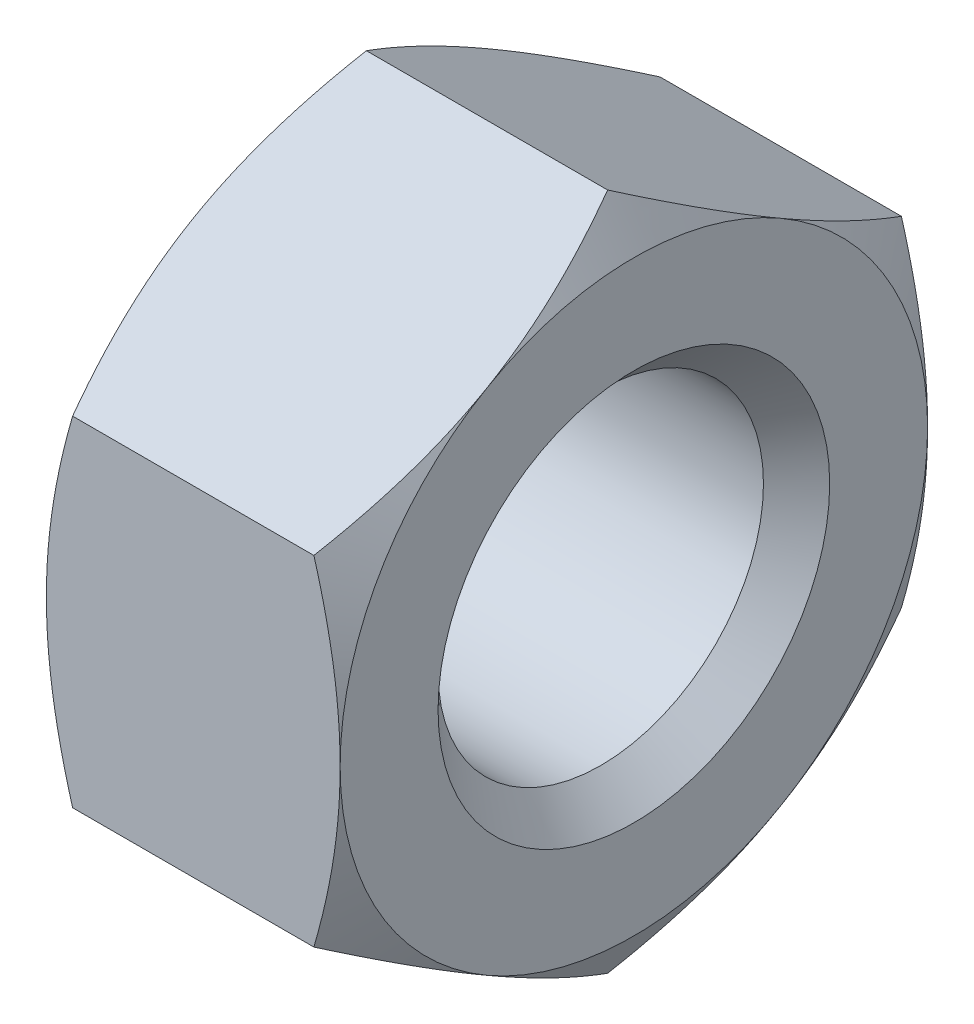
ISO-10303-21;
HEADER;
FILE_DESCRIPTION(('STEP AP214'),'2;1');
FILE_NAME('part.step','',(''),(''),'','','');
FILE_SCHEMA(('AUTOMOTIVE_DESIGN { 1 0 10303 214 1 1 1 1 }'));
ENDSEC;
DATA;
#1=APPLICATION_CONTEXT('core data for automotive mechanical design processes');
#2=APPLICATION_PROTOCOL_DEFINITION('international standard','automotive_design',2000,#1);
#3=PRODUCT_CONTEXT('',#1,'mechanical');
#4=PRODUCT('Part','Part','',(#3));
#5=PRODUCT_RELATED_PRODUCT_CATEGORY('part','',(#4));
#6=PRODUCT_DEFINITION_FORMATION('','',#4);
#7=PRODUCT_DEFINITION_CONTEXT('part definition',#1,'design');
#8=PRODUCT_DEFINITION('design','',#6,#7);
#9=PRODUCT_DEFINITION_SHAPE('','',#8);
#10=(LENGTH_UNIT() NAMED_UNIT(*) SI_UNIT(.MILLI.,.METRE.));
#11=(NAMED_UNIT(*) PLANE_ANGLE_UNIT() SI_UNIT($,.RADIAN.));
#12=(NAMED_UNIT(*) SI_UNIT($,.STERADIAN.) SOLID_ANGLE_UNIT());
#13=UNCERTAINTY_MEASURE_WITH_UNIT(LENGTH_MEASURE(1.E-05),#10,'distance_accuracy_value','');
#14=(GEOMETRIC_REPRESENTATION_CONTEXT(3) GLOBAL_UNCERTAINTY_ASSIGNED_CONTEXT((#13)) GLOBAL_UNIT_ASSIGNED_CONTEXT((#10,
#11,#12)) REPRESENTATION_CONTEXT('',''));
#15=CARTESIAN_POINT('',(0.,0.,0.));
#16=DIRECTION('',(0.,0.,1.));
#17=DIRECTION('',(1.,0.,0.));
#18=AXIS2_PLACEMENT_3D('',#15,#16,#17);
#19=CARTESIAN_POINT('',(-2.30717967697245,0.,0.));
#20=DIRECTION('',(1.,0.,0.));
#21=DIRECTION('',(0.,0.,-1.));
#22=AXIS2_PLACEMENT_3D('',#19,#20,#21);
#23=CONICAL_SURFACE('',#22,7.2,1.0471975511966);
#24=CARTESIAN_POINT('',(-0.118306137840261,-9.20909119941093,-6.));
#25=CARTESIAN_POINT('',(-0.244656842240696,-8.94782108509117,-6.));
#26=CARTESIAN_POINT('',(-0.369767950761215,-8.68594078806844,-6.));
#27=CARTESIAN_POINT('',(-0.616811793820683,-8.16063496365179,-6.));
#28=CARTESIAN_POINT('',(-0.73874400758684,-7.89720919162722,-6.));
#29=CARTESIAN_POINT('',(-0.9793650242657,-7.36708364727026,-6.));
#30=CARTESIAN_POINT('',(-1.09803169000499,-7.10037379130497,-6.));
#31=CARTESIAN_POINT('',(-1.33037878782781,-6.56479885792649,-6.));
#32=CARTESIAN_POINT('',(-1.44405946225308,-6.29593388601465,-6.));
#33=CARTESIAN_POINT('',(-1.66851104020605,-5.74732037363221,-6.));
#34=CARTESIAN_POINT('',(-1.77908558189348,-5.46749104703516,-6.));
#35=CARTESIAN_POINT('',(-1.99163115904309,-4.90452304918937,-6.));
#36=CARTESIAN_POINT('',(-2.09360121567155,-4.62138400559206,-6.));
#37=CARTESIAN_POINT('',(-2.28619063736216,-4.05190899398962,-6.));
#38=CARTESIAN_POINT('',(-2.37683383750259,-3.7655811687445,-6.));
#39=CARTESIAN_POINT('',(-2.54379680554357,-3.18881717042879,-6.));
#40=CARTESIAN_POINT('',(-2.6201211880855,-2.89838235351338,-6.));
#41=CARTESIAN_POINT('',(-2.75432444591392,-2.31484737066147,-6.));
#42=CARTESIAN_POINT('',(-2.81229968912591,-2.0217697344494,-6.));
#43=CARTESIAN_POINT('',(-2.90644807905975,-1.43203168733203,-6.));
#44=CARTESIAN_POINT('',(-2.94262309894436,-1.13537158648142,-6.));
#45=CARTESIAN_POINT('',(-2.97813125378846,-0.690839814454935,-6.));
#46=CARTESIAN_POINT('',(-2.98684433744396,-0.543679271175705,-6.));
#47=CARTESIAN_POINT('',(-2.9980522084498,-0.249115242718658,-6.));
#48=CARTESIAN_POINT('',(-3.00054709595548,-0.101711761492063,-6.));
#49=CARTESIAN_POINT('',(-2.99925213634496,0.19306753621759,-6.));
#50=CARTESIAN_POINT('',(-2.995462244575,0.340443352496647,-6.));
#51=CARTESIAN_POINT('',(-2.98169046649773,0.634907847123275,-6.));
#52=CARTESIAN_POINT('',(-2.9717082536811,0.781996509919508,-6.));
#53=CARTESIAN_POINT('',(-2.94022031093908,1.13846097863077,-6.));
#54=CARTESIAN_POINT('',(-2.91561188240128,1.34756813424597,-6.));
#55=CARTESIAN_POINT('',(-2.85524472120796,1.76415682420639,-6.));
#56=CARTESIAN_POINT('',(-2.81948438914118,1.97163812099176,-6.));
#57=CARTESIAN_POINT('',(-2.69737811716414,2.59144783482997,-6.));
#58=CARTESIAN_POINT('',(-2.59623155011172,3.00089489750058,-6.));
#59=CARTESIAN_POINT('',(-2.4217707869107,3.61299325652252,-6.));
#60=CARTESIAN_POINT('',(-2.3590393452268,3.8188425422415,-6.));
#61=CARTESIAN_POINT('',(-2.22729411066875,4.22854051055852,-6.));
#62=CARTESIAN_POINT('',(-2.15828027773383,4.4323891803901,-6.));
#63=CARTESIAN_POINT('',(-2.01505801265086,4.83815451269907,-6.));
#64=CARTESIAN_POINT('',(-1.94085144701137,5.0400718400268,-6.));
#65=CARTESIAN_POINT('',(-1.78809344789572,5.4422495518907,-6.));
#66=CARTESIAN_POINT('',(-1.70954205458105,5.64250995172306,-6.));
#67=CARTESIAN_POINT('',(-1.52643465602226,6.09713936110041,-6.));
#68=CARTESIAN_POINT('',(-1.42072916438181,6.35104440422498,-6.));
#69=CARTESIAN_POINT('',(-1.20459094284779,6.85683967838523,-6.));
#70=CARTESIAN_POINT('',(-1.09415798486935,7.10872981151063,-6.));
#71=CARTESIAN_POINT('',(-0.86946780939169,7.61084474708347,-6.));
#72=CARTESIAN_POINT('',(-0.755209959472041,7.86106926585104,-6.));
#73=CARTESIAN_POINT('',(-0.52359145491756,8.3600801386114,-6.));
#74=CARTESIAN_POINT('',(-0.406230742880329,8.60886646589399,-6.));
#75=CARTESIAN_POINT('',(-0.0501523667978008,9.35383732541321,-6.));
#76=CARTESIAN_POINT('',(0.192366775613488,9.84820396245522,-6.));
#77=CARTESIAN_POINT('',(0.684389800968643,10.833448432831,-6.));
#78=CARTESIAN_POINT('',(0.933893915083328,11.3243261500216,-6.));
#79=CARTESIAN_POINT('',(1.30210957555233,12.0396203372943,-6.));
#80=CARTESIAN_POINT('',(1.41883814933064,12.2650605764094,-6.));
#81=CARTESIAN_POINT('',(1.6532287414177,12.7154504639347,-6.));
#82=CARTESIAN_POINT('',(1.77089074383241,12.9404001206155,-6.));
#83=CARTESIAN_POINT('',(2.12510158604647,13.6146260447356,-6.));
#84=CARTESIAN_POINT('',(2.3628669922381,14.0632632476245,-6.));
#85=CARTESIAN_POINT('',(2.84036252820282,14.9582212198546,-6.));
#86=CARTESIAN_POINT('',(3.08008718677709,15.4045449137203,-6.));
#87=CARTESIAN_POINT('',(3.56150708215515,16.2961005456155,-6.));
#88=CARTESIAN_POINT('',(3.80320222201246,16.7413325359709,-6.));
#89=CARTESIAN_POINT('',(4.04563992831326,17.1861572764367,-6.));
#90=B_SPLINE_CURVE_WITH_KNOTS('',3,(#24,#25,#26,#27,#28,#29,#30,#31,#32,#33,#34,#35,#36,#37,#38,
#39,#40,#41,#42,#43,#44,#45,#46,#47,#48,#49,#50,#51,#52,#53,#54,#55,#56,#57,#58,#59,#60,#61,#62,
#63,#64,#65,#66,#67,#68,#69,#70,#71,#72,#73,#74,#75,#76,#77,#78,#79,#80,#81,#82,#83,#84,#85,#86,
#87,#88,#89),.UNSPECIFIED.,.F.,.F.,(4,2,2,2,2,2,2,2,2,2,2,2,2,2,2,2,2,2,2,2,2,2,2,2,2,2,2,2,2,2,
2,2,4),(0.,0.870665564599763,1.74147287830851,2.61718508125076,3.49285467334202,
4.39539749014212,5.29804284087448,6.19875557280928,7.09917752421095,7.99478890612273,
8.89032332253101,9.33246667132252,9.77460289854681,10.2167422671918,10.658904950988,
11.290196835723,11.9215793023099,13.1850861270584,13.830622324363,14.4761626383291,
15.1214720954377,15.7667755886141,16.5918024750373,17.4168692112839,18.2420730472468,
19.0672921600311,20.7191456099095,22.3710537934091,23.1326554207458,23.894244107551,
25.4174755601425,26.9373569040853,28.457163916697),.UNSPECIFIED.);
#91=CARTESIAN_POINT('',(-2.46410161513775,-3.46410161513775,-6.));
#92=VERTEX_POINT('',#91);
#93=CARTESIAN_POINT('',(-3.,0.,-6.));
#94=VERTEX_POINT('',#93);
#95=EDGE_CURVE('E333',#92,#94,#90,.T.);
#96=ORIENTED_EDGE('',*,*,#95,.F.);
#97=CARTESIAN_POINT('',(-2.46403494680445,-6.92831870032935,0.000200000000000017));
#98=CARTESIAN_POINT('',(-2.50799100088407,-6.85217369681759,-0.131687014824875));
#99=CARTESIAN_POINT('',(-2.5499521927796,-6.7757447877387,-0.264065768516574));
#100=CARTESIAN_POINT('',(-2.62933542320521,-6.62226628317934,-0.52989833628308));
#101=CARTESIAN_POINT('',(-2.66675550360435,-6.54521643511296,-0.663352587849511));
#102=CARTESIAN_POINT('',(-2.77146958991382,-6.31283321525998,-1.06585213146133));
#103=CARTESIAN_POINT('',(-2.83102994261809,-6.15658254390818,-1.33648623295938));
#104=CARTESIAN_POINT('',(-2.90087178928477,-5.92275625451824,-1.74148524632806));
#105=CARTESIAN_POINT('',(-2.92076777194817,-5.84587929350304,-1.87464004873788));
#106=CARTESIAN_POINT('',(-2.95413058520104,-5.69177799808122,-2.14155132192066));
#107=CARTESIAN_POINT('',(-2.96759798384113,-5.6145536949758,-2.27530773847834));
#108=CARTESIAN_POINT('',(-2.98776040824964,-5.45997096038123,-2.54305288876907));
#109=CARTESIAN_POINT('',(-2.99446312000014,-5.38261278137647,-2.67704118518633));
#110=CARTESIAN_POINT('',(-3.00095963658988,-5.22782922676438,-2.94513416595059));
#111=CARTESIAN_POINT('',(-3.00075365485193,-5.1504038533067,-3.07923884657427));
#112=CARTESIAN_POINT('',(-2.99069281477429,-4.93828180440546,-3.44664501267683));
#113=CARTESIAN_POINT('',(-2.97380210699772,-4.80365456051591,-3.67982623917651));
#114=CARTESIAN_POINT('',(-2.92024077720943,-4.53529425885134,-4.14463991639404));
#115=CARTESIAN_POINT('',(-2.88355184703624,-4.40156214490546,-4.3762707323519));
#116=CARTESIAN_POINT('',(-2.7918398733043,-4.13266173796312,-4.84201989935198));
#117=CARTESIAN_POINT('',(-2.73642824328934,-3.99752737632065,-5.07607947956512));
#118=CARTESIAN_POINT('',(-2.61066608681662,-3.7292739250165,-5.54070808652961));
#119=CARTESIAN_POINT('',(-2.54034510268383,-3.59615139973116,-5.77128306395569));
#120=CARTESIAN_POINT('',(-2.46403494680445,-3.46398614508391,-6.0002));
#121=B_SPLINE_CURVE_WITH_KNOTS('',3,(#97,#98,#99,#100,#101,#102,#103,#104,#105,#106,#107,#108,
#109,#110,#111,#112,#113,#114,#115,#116,#117,#118,#119,#120),.UNSPECIFIED.,.F.,.F.,(4,2,2,2,2,2,
2,2,2,2,2,4),(0.,0.475482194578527,0.951168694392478,1.90451835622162,2.36951738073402,
2.83447530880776,3.29890435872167,3.76331906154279,4.57182194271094,5.38107376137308,
6.20827406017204,7.03385036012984),.UNSPECIFIED.);
#122=CARTESIAN_POINT('',(-3.,-5.19615242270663,-3.));
#123=VERTEX_POINT('',#122);
#124=EDGE_CURVE('E168',#123,#92,#121,.T.);
#125=ORIENTED_EDGE('',*,*,#124,.F.);
#126=CARTESIAN_POINT('',(-3.,0.,0.));
#127=DIRECTION('',(-1.,0.,0.));
#128=DIRECTION('',(0.,0.,1.));
#129=AXIS2_PLACEMENT_3D('',#126,#127,#128);
#130=CIRCLE('',#129,6.);
#131=EDGE_CURVE('E324',#94,#123,#130,.T.);
#132=ORIENTED_EDGE('',*,*,#131,.F.);
#133=EDGE_LOOP('',(#96,#125,#132));
#134=FACE_BOUND('',#133,.T.);
#135=ADVANCED_FACE('F16',(#134),#23,.T.);
#136=CARTESIAN_POINT('',(-2.46410161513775,3.46410161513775,-6.));
#137=VERTEX_POINT('',#136);
#138=EDGE_CURVE('E176',#94,#137,#90,.T.);
#139=ORIENTED_EDGE('',*,*,#138,.F.);
#140=CARTESIAN_POINT('',(-3.,5.19615242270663,-3.));
#141=VERTEX_POINT('',#140);
#142=EDGE_CURVE('E325',#141,#94,#130,.T.);
#143=ORIENTED_EDGE('',*,*,#142,.F.);
#144=CARTESIAN_POINT('',(-2.46403494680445,3.46398614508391,-6.0002));
#145=CARTESIAN_POINT('',(-2.50799100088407,3.54013114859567,-5.86831298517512));
#146=CARTESIAN_POINT('',(-2.5499521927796,3.61656005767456,-5.73593423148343));
#147=CARTESIAN_POINT('',(-2.62933542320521,3.77003856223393,-5.47010166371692));
#148=CARTESIAN_POINT('',(-2.66675550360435,3.84708841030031,-5.33664741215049));
#149=CARTESIAN_POINT('',(-2.77146958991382,4.07947163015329,-4.93414786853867));
#150=CARTESIAN_POINT('',(-2.83102994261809,4.23572230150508,-4.66351376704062));
#151=CARTESIAN_POINT('',(-2.90087178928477,4.46954859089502,-4.25851475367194));
#152=CARTESIAN_POINT('',(-2.92076777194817,4.54642555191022,-4.12535995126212));
#153=CARTESIAN_POINT('',(-2.95413058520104,4.70052684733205,-3.85844867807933));
#154=CARTESIAN_POINT('',(-2.96759798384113,4.77775115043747,-3.72469226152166));
#155=CARTESIAN_POINT('',(-2.98776040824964,4.93233388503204,-3.45694711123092));
#156=CARTESIAN_POINT('',(-2.99446312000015,5.0096920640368,-3.32295881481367));
#157=CARTESIAN_POINT('',(-3.00095963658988,5.16447561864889,-3.05486583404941));
#158=CARTESIAN_POINT('',(-3.00075365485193,5.24190099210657,-2.92076115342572));
#159=CARTESIAN_POINT('',(-2.99069281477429,5.45402304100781,-2.55335498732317));
#160=CARTESIAN_POINT('',(-2.97380210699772,5.58865028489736,-2.32017376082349));
#161=CARTESIAN_POINT('',(-2.92024077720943,5.85701058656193,-1.85536008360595));
#162=CARTESIAN_POINT('',(-2.88355184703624,5.99074270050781,-1.6237292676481));
#163=CARTESIAN_POINT('',(-2.7918398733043,6.25964310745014,-1.15798010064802));
#164=CARTESIAN_POINT('',(-2.73642824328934,6.39477746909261,-0.923920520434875));
#165=CARTESIAN_POINT('',(-2.61066608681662,6.66303092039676,-0.459291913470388));
#166=CARTESIAN_POINT('',(-2.54034510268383,6.7961534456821,-0.228716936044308));
#167=CARTESIAN_POINT('',(-2.46403494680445,6.92831870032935,0.00019999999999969));
#168=B_SPLINE_CURVE_WITH_KNOTS('',3,(#144,#145,#146,#147,#148,#149,#150,#151,#152,#153,#154,
#155,#156,#157,#158,#159,#160,#161,#162,#163,#164,#165,#166,#167),.UNSPECIFIED.,.F.,.F.,(4,2,2,
2,2,2,2,2,2,2,2,4),(0.,0.475482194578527,0.951168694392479,1.90451835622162,2.36951738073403,
2.83447530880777,3.29890435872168,3.76331906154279,4.57182194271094,5.38107376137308,
6.20827406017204,7.03385036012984),.UNSPECIFIED.);
#169=EDGE_CURVE('E191',#137,#141,#168,.T.);
#170=ORIENTED_EDGE('',*,*,#169,.F.);
#171=EDGE_LOOP('',(#139,#143,#170));
#172=FACE_BOUND('',#171,.T.);
#173=ADVANCED_FACE('F150',(#172),#23,.T.);
#174=CARTESIAN_POINT('',(-2.46410161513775,6.92820323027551,0.));
#175=VERTEX_POINT('',#174);
#176=EDGE_CURVE('E184',#141,#175,#168,.T.);
#177=ORIENTED_EDGE('',*,*,#176,.F.);
#178=CARTESIAN_POINT('',(-3.,5.19615242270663,3.));
#179=VERTEX_POINT('',#178);
#180=EDGE_CURVE('E24',#179,#141,#130,.T.);
#181=ORIENTED_EDGE('',*,*,#180,.F.);
#182=CARTESIAN_POINT('',(-2.46403494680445,6.92831870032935,-0.000200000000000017));
#183=CARTESIAN_POINT('',(-2.50799100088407,6.85217369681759,0.131687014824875));
#184=CARTESIAN_POINT('',(-2.5499521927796,6.7757447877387,0.264065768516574));
#185=CARTESIAN_POINT('',(-2.62933542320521,6.62226628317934,0.52989833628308));
#186=CARTESIAN_POINT('',(-2.66675550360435,6.54521643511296,0.663352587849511));
#187=CARTESIAN_POINT('',(-2.77146958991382,6.31283321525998,1.06585213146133));
#188=CARTESIAN_POINT('',(-2.83102994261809,6.15658254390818,1.33648623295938));
#189=CARTESIAN_POINT('',(-2.90087178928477,5.92275625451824,1.74148524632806));
#190=CARTESIAN_POINT('',(-2.92076777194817,5.84587929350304,1.87464004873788));
#191=CARTESIAN_POINT('',(-2.95413058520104,5.69177799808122,2.14155132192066));
#192=CARTESIAN_POINT('',(-2.96759798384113,5.6145536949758,2.27530773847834));
#193=CARTESIAN_POINT('',(-2.98776040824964,5.45997096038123,2.54305288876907));
#194=CARTESIAN_POINT('',(-2.99446312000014,5.38261278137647,2.67704118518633));
#195=CARTESIAN_POINT('',(-3.00095963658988,5.22782922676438,2.94513416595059));
#196=CARTESIAN_POINT('',(-3.00075365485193,5.1504038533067,3.07923884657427));
#197=CARTESIAN_POINT('',(-2.99069281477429,4.93828180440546,3.44664501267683));
#198=CARTESIAN_POINT('',(-2.97380210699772,4.80365456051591,3.67982623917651));
#199=CARTESIAN_POINT('',(-2.92024077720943,4.53529425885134,4.14463991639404));
#200=CARTESIAN_POINT('',(-2.88355184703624,4.40156214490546,4.3762707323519));
#201=CARTESIAN_POINT('',(-2.7918398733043,4.13266173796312,4.84201989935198));
#202=CARTESIAN_POINT('',(-2.73642824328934,3.99752737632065,5.07607947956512));
#203=CARTESIAN_POINT('',(-2.61066608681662,3.7292739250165,5.54070808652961));
#204=CARTESIAN_POINT('',(-2.54034510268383,3.59615139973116,5.77128306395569));
#205=CARTESIAN_POINT('',(-2.46403494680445,3.46398614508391,6.0002));
#206=B_SPLINE_CURVE_WITH_KNOTS('',3,(#182,#183,#184,#185,#186,#187,#188,#189,#190,#191,#192,
#193,#194,#195,#196,#197,#198,#199,#200,#201,#202,#203,#204,#205),.UNSPECIFIED.,.F.,.F.,(4,2,2,
2,2,2,2,2,2,2,2,4),(0.,0.475482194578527,0.951168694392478,1.90451835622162,2.36951738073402,
2.83447530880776,3.29890435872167,3.76331906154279,4.57182194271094,5.38107376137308,
6.20827406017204,7.03385036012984),.UNSPECIFIED.);
#207=EDGE_CURVE('E113',#175,#179,#206,.T.);
#208=ORIENTED_EDGE('',*,*,#207,.F.);
#209=EDGE_LOOP('',(#177,#181,#208));
#210=FACE_BOUND('',#209,.T.);
#211=ADVANCED_FACE('F338',(#210),#23,.T.);
#212=CARTESIAN_POINT('',(-2.46410161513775,-6.92820323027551,0.));
#213=VERTEX_POINT('',#212);
#214=EDGE_CURVE('E221',#213,#123,#121,.T.);
#215=ORIENTED_EDGE('',*,*,#214,.F.);
#216=CARTESIAN_POINT('',(-2.46403494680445,-3.46398614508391,6.0002));
#217=CARTESIAN_POINT('',(-2.50799100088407,-3.54013114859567,5.86831298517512));
#218=CARTESIAN_POINT('',(-2.5499521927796,-3.61656005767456,5.73593423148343));
#219=CARTESIAN_POINT('',(-2.62933542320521,-3.77003856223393,5.47010166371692));
#220=CARTESIAN_POINT('',(-2.66675550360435,-3.84708841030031,5.33664741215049));
#221=CARTESIAN_POINT('',(-2.77146958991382,-4.07947163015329,4.93414786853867));
#222=CARTESIAN_POINT('',(-2.83102994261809,-4.23572230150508,4.66351376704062));
#223=CARTESIAN_POINT('',(-2.90087178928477,-4.46954859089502,4.25851475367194));
#224=CARTESIAN_POINT('',(-2.92076777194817,-4.54642555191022,4.12535995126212));
#225=CARTESIAN_POINT('',(-2.95413058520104,-4.70052684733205,3.85844867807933));
#226=CARTESIAN_POINT('',(-2.96759798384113,-4.77775115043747,3.72469226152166));
#227=CARTESIAN_POINT('',(-2.98776040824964,-4.93233388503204,3.45694711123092));
#228=CARTESIAN_POINT('',(-2.99446312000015,-5.0096920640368,3.32295881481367));
#229=CARTESIAN_POINT('',(-3.00095963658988,-5.16447561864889,3.05486583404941));
#230=CARTESIAN_POINT('',(-3.00075365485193,-5.24190099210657,2.92076115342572));
#231=CARTESIAN_POINT('',(-2.99069281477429,-5.45402304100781,2.55335498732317));
#232=CARTESIAN_POINT('',(-2.97380210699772,-5.58865028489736,2.32017376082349));
#233=CARTESIAN_POINT('',(-2.92024077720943,-5.85701058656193,1.85536008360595));
#234=CARTESIAN_POINT('',(-2.88355184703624,-5.99074270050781,1.6237292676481));
#235=CARTESIAN_POINT('',(-2.7918398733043,-6.25964310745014,1.15798010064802));
#236=CARTESIAN_POINT('',(-2.73642824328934,-6.39477746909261,0.923920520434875));
#237=CARTESIAN_POINT('',(-2.61066608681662,-6.66303092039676,0.459291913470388));
#238=CARTESIAN_POINT('',(-2.54034510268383,-6.7961534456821,0.228716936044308));
#239=CARTESIAN_POINT('',(-2.46403494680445,-6.92831870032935,-0.00019999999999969));
#240=B_SPLINE_CURVE_WITH_KNOTS('',3,(#216,#217,#218,#219,#220,#221,#222,#223,#224,#225,#226,
#227,#228,#229,#230,#231,#232,#233,#234,#235,#236,#237,#238,#239),.UNSPECIFIED.,.F.,.F.,(4,2,2,
2,2,2,2,2,2,2,2,4),(0.,0.475482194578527,0.951168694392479,1.90451835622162,2.36951738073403,
2.83447530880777,3.29890435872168,3.76331906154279,4.57182194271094,5.38107376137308,
6.20827406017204,7.03385036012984),.UNSPECIFIED.);
#241=CARTESIAN_POINT('',(-3.,-5.19615242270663,3.));
#242=VERTEX_POINT('',#241);
#243=EDGE_CURVE('E160',#242,#213,#240,.T.);
#244=ORIENTED_EDGE('',*,*,#243,.F.);
#245=EDGE_CURVE('E322',#123,#242,#130,.T.);
#246=ORIENTED_EDGE('',*,*,#245,.F.);
#247=EDGE_LOOP('',(#215,#244,#246));
#248=FACE_BOUND('',#247,.T.);
#249=ADVANCED_FACE('F336',(#248),#23,.T.);
#250=CARTESIAN_POINT('',(-2.46410161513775,3.46410161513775,6.));
#251=VERTEX_POINT('',#250);
#252=EDGE_CURVE('E107',#179,#251,#206,.T.);
#253=ORIENTED_EDGE('',*,*,#252,.F.);
#254=CARTESIAN_POINT('',(-3.,0.,6.));
#255=VERTEX_POINT('',#254);
#256=EDGE_CURVE('E11',#255,#179,#130,.T.);
#257=ORIENTED_EDGE('',*,*,#256,.F.);
#258=CARTESIAN_POINT('',(-0.11830613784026,-9.20909119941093,6.));
#259=CARTESIAN_POINT('',(-0.244656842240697,-8.94782108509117,6.));
#260=CARTESIAN_POINT('',(-0.369767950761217,-8.68594078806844,6.));
#261=CARTESIAN_POINT('',(-0.616811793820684,-8.16063496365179,6.));
#262=CARTESIAN_POINT('',(-0.738744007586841,-7.89720919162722,6.));
#263=CARTESIAN_POINT('',(-0.9793650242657,-7.36708364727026,6.));
#264=CARTESIAN_POINT('',(-1.09803169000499,-7.10037379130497,6.));
#265=CARTESIAN_POINT('',(-1.33037878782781,-6.56479885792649,6.));
#266=CARTESIAN_POINT('',(-1.44405946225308,-6.29593388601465,6.));
#267=CARTESIAN_POINT('',(-1.66851104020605,-5.74732037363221,6.));
#268=CARTESIAN_POINT('',(-1.77908558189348,-5.46749104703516,6.));
#269=CARTESIAN_POINT('',(-1.99163115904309,-4.90452304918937,6.));
#270=CARTESIAN_POINT('',(-2.09360121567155,-4.62138400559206,6.));
#271=CARTESIAN_POINT('',(-2.28619063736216,-4.05190899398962,6.));
#272=CARTESIAN_POINT('',(-2.37683383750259,-3.7655811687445,6.));
#273=CARTESIAN_POINT('',(-2.54379680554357,-3.18881717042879,6.));
#274=CARTESIAN_POINT('',(-2.6201211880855,-2.89838235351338,6.));
#275=CARTESIAN_POINT('',(-2.75432444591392,-2.31484737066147,6.));
#276=CARTESIAN_POINT('',(-2.81229968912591,-2.0217697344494,6.));
#277=CARTESIAN_POINT('',(-2.90644807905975,-1.43203168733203,6.));
#278=CARTESIAN_POINT('',(-2.94262309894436,-1.13537158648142,6.));
#279=CARTESIAN_POINT('',(-2.97813125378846,-0.690839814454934,6.));
#280=CARTESIAN_POINT('',(-2.98684433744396,-0.543679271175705,6.));
#281=CARTESIAN_POINT('',(-2.9980522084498,-0.249115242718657,6.));
#282=CARTESIAN_POINT('',(-3.00054709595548,-0.101711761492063,6.));
#283=CARTESIAN_POINT('',(-2.99925213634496,0.19306753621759,6.));
#284=CARTESIAN_POINT('',(-2.995462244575,0.340443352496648,6.));
#285=CARTESIAN_POINT('',(-2.98169046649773,0.634907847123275,6.));
#286=CARTESIAN_POINT('',(-2.9717082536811,0.781996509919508,6.));
#287=CARTESIAN_POINT('',(-2.94022031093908,1.13846097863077,6.));
#288=CARTESIAN_POINT('',(-2.91561188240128,1.34756813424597,6.));
#289=CARTESIAN_POINT('',(-2.85524472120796,1.76415682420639,6.));
#290=CARTESIAN_POINT('',(-2.81948438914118,1.97163812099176,6.));
#291=CARTESIAN_POINT('',(-2.69737811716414,2.59144783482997,6.));
#292=CARTESIAN_POINT('',(-2.59623155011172,3.00089489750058,6.));
#293=CARTESIAN_POINT('',(-2.4217707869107,3.61299325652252,6.));
#294=CARTESIAN_POINT('',(-2.3590393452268,3.81884254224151,6.));
#295=CARTESIAN_POINT('',(-2.22729411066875,4.22854051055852,6.));
#296=CARTESIAN_POINT('',(-2.15828027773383,4.4323891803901,6.));
#297=CARTESIAN_POINT('',(-2.01505801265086,4.83815451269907,6.));
#298=CARTESIAN_POINT('',(-1.94085144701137,5.0400718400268,6.));
#299=CARTESIAN_POINT('',(-1.78809344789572,5.4422495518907,6.));
#300=CARTESIAN_POINT('',(-1.70954205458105,5.64250995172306,6.));
#301=CARTESIAN_POINT('',(-1.52643465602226,6.09713936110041,6.));
#302=CARTESIAN_POINT('',(-1.42072916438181,6.35104440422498,6.));
#303=CARTESIAN_POINT('',(-1.2045909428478,6.85683967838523,6.));
#304=CARTESIAN_POINT('',(-1.09415798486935,7.10872981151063,6.));
#305=CARTESIAN_POINT('',(-0.86946780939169,7.61084474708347,6.));
#306=CARTESIAN_POINT('',(-0.755209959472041,7.86106926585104,6.));
#307=CARTESIAN_POINT('',(-0.52359145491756,8.3600801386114,6.));
#308=CARTESIAN_POINT('',(-0.406230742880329,8.60886646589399,6.));
#309=CARTESIAN_POINT('',(-0.0501523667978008,9.35383732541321,6.));
#310=CARTESIAN_POINT('',(0.192366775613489,9.84820396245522,6.));
#311=CARTESIAN_POINT('',(0.684389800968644,10.833448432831,6.));
#312=CARTESIAN_POINT('',(0.933893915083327,11.3243261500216,6.));
#313=CARTESIAN_POINT('',(1.30210957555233,12.0396203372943,6.));
#314=CARTESIAN_POINT('',(1.41883814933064,12.2650605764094,6.));
#315=CARTESIAN_POINT('',(1.6532287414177,12.7154504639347,6.));
#316=CARTESIAN_POINT('',(1.77089074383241,12.9404001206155,6.));
#317=CARTESIAN_POINT('',(2.12510158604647,13.6146260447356,6.));
#318=CARTESIAN_POINT('',(2.3628669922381,14.0632632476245,6.));
#319=CARTESIAN_POINT('',(2.84036252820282,14.9582212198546,6.));
#320=CARTESIAN_POINT('',(3.08008718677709,15.4045449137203,6.));
#321=CARTESIAN_POINT('',(3.56150708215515,16.2961005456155,6.));
#322=CARTESIAN_POINT('',(3.80320222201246,16.7413325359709,6.));
#323=CARTESIAN_POINT('',(4.04563992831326,17.1861572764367,6.));
#324=B_SPLINE_CURVE_WITH_KNOTS('',3,(#258,#259,#260,#261,#262,#263,#264,#265,#266,#267,#268,
#269,#270,#271,#272,#273,#274,#275,#276,#277,#278,#279,#280,#281,#282,#283,#284,#285,#286,#287,
#288,#289,#290,#291,#292,#293,#294,#295,#296,#297,#298,#299,#300,#301,#302,#303,#304,#305,#306,
#307,#308,#309,#310,#311,#312,#313,#314,#315,#316,#317,#318,#319,#320,#321,#322,#323),
.UNSPECIFIED.,.F.,.F.,(4,2,2,2,2,2,2,2,2,2,2,2,2,2,2,2,2,2,2,2,2,2,2,2,2,2,2,2,2,2,2,2,4),(0.,
0.870665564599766,1.74147287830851,2.61718508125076,3.49285467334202,4.39539749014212,
5.29804284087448,6.19875557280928,7.09917752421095,7.99478890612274,8.89032332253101,
9.33246667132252,9.77460289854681,10.2167422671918,10.658904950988,11.290196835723,
11.9215793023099,13.1850861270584,13.830622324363,14.4761626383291,15.1214720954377,
15.7667755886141,16.5918024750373,17.4168692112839,18.2420730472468,19.0672921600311,
20.7191456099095,22.3710537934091,23.1326554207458,23.894244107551,25.4174755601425,
26.9373569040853,28.457163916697),.UNSPECIFIED.);
#325=EDGE_CURVE('E32',#251,#255,#324,.F.);
#326=ORIENTED_EDGE('',*,*,#325,.F.);
#327=EDGE_LOOP('',(#253,#257,#326));
#328=FACE_BOUND('',#327,.T.);
#329=ADVANCED_FACE('F123',(#328),#23,.T.);
#330=CARTESIAN_POINT('',(-2.46410161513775,-3.46410161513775,6.));
#331=VERTEX_POINT('',#330);
#332=EDGE_CURVE('E233',#331,#242,#240,.T.);
#333=ORIENTED_EDGE('',*,*,#332,.F.);
#334=EDGE_CURVE('E125',#255,#331,#324,.F.);
#335=ORIENTED_EDGE('',*,*,#334,.F.);
#336=EDGE_CURVE('E25',#242,#255,#130,.T.);
#337=ORIENTED_EDGE('',*,*,#336,.F.);
#338=EDGE_LOOP('',(#333,#335,#337));
#339=FACE_BOUND('',#338,.T.);
#340=ADVANCED_FACE('F152',(#339),#23,.T.);
#341=CARTESIAN_POINT('',(3.,0.,0.));
#342=DIRECTION('',(-1.,0.,0.));
#343=DIRECTION('',(0.,0.,1.));
#344=AXIS2_PLACEMENT_3D('',#341,#342,#343);
#345=CONICAL_SURFACE('',#344,6.,1.0471975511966);
#346=CARTESIAN_POINT('',(2.46403494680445,3.46398614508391,6.0002));
#347=CARTESIAN_POINT('',(2.50799100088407,3.54013114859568,5.86831298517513));
#348=CARTESIAN_POINT('',(2.5499521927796,3.61656005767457,5.73593423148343));
#349=CARTESIAN_POINT('',(2.62933542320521,3.77003856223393,5.47010166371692));
#350=CARTESIAN_POINT('',(2.66675550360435,3.84708841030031,5.33664741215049));
#351=CARTESIAN_POINT('',(2.77146958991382,4.07947163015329,4.93414786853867));
#352=CARTESIAN_POINT('',(2.83102994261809,4.23572230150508,4.66351376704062));
#353=CARTESIAN_POINT('',(2.90087178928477,4.46954859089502,4.25851475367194));
#354=CARTESIAN_POINT('',(2.92076777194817,4.54642555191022,4.12535995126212));
#355=CARTESIAN_POINT('',(2.95413058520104,4.70052684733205,3.85844867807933));
#356=CARTESIAN_POINT('',(2.96759798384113,4.77775115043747,3.72469226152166));
#357=CARTESIAN_POINT('',(2.98776040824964,4.93233388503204,3.45694711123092));
#358=CARTESIAN_POINT('',(2.99446312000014,5.0096920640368,3.32295881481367));
#359=CARTESIAN_POINT('',(3.00095963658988,5.16447561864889,3.05486583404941));
#360=CARTESIAN_POINT('',(3.00075365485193,5.24190099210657,2.92076115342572));
#361=CARTESIAN_POINT('',(2.99069281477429,5.45402304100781,2.55335498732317));
#362=CARTESIAN_POINT('',(2.97380210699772,5.58865028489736,2.32017376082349));
#363=CARTESIAN_POINT('',(2.92024077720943,5.85701058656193,1.85536008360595));
#364=CARTESIAN_POINT('',(2.88355184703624,5.99074270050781,1.6237292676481));
#365=CARTESIAN_POINT('',(2.7918398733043,6.25964310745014,1.15798010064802));
#366=CARTESIAN_POINT('',(2.73642824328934,6.39477746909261,0.923920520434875));
#367=CARTESIAN_POINT('',(2.61066608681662,6.66303092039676,0.459291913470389));
#368=CARTESIAN_POINT('',(2.54034510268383,6.7961534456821,0.228716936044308));
#369=CARTESIAN_POINT('',(2.46403494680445,6.92831870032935,-0.000200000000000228));
#370=B_SPLINE_CURVE_WITH_KNOTS('',3,(#346,#347,#348,#349,#350,#351,#352,#353,#354,#355,#356,
#357,#358,#359,#360,#361,#362,#363,#364,#365,#366,#367,#368,#369),.UNSPECIFIED.,.F.,.F.,(4,2,2,
2,2,2,2,2,2,2,2,4),(0.,0.475482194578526,0.951168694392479,1.90451835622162,2.36951738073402,
2.83447530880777,3.29890435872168,3.76331906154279,4.57182194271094,5.38107376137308,
6.20827406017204,7.03385036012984),.UNSPECIFIED.);
#371=CARTESIAN_POINT('',(2.46410161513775,3.46410161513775,6.));
#372=VERTEX_POINT('',#371);
#373=CARTESIAN_POINT('',(3.,5.19615242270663,3.));
#374=VERTEX_POINT('',#373);
#375=EDGE_CURVE('E117',#372,#374,#370,.T.);
#376=ORIENTED_EDGE('',*,*,#375,.F.);
#377=CARTESIAN_POINT('',(0.118306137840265,-9.20909119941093,6.));
#378=CARTESIAN_POINT('',(0.244656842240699,-8.94782108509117,6.));
#379=CARTESIAN_POINT('',(0.369767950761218,-8.68594078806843,6.));
#380=CARTESIAN_POINT('',(0.616811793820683,-8.16063496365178,6.));
#381=CARTESIAN_POINT('',(0.73874400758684,-7.89720919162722,6.));
#382=CARTESIAN_POINT('',(0.9793650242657,-7.36708364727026,6.));
#383=CARTESIAN_POINT('',(1.09803169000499,-7.10037379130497,6.));
#384=CARTESIAN_POINT('',(1.33037878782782,-6.56479885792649,6.));
#385=CARTESIAN_POINT('',(1.44405946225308,-6.29593388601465,6.));
#386=CARTESIAN_POINT('',(1.66851104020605,-5.74732037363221,6.));
#387=CARTESIAN_POINT('',(1.77908558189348,-5.46749104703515,6.));
#388=CARTESIAN_POINT('',(1.99163115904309,-4.90452304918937,6.));
#389=CARTESIAN_POINT('',(2.09360121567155,-4.62138400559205,6.));
#390=CARTESIAN_POINT('',(2.28619063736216,-4.05190899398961,6.));
#391=CARTESIAN_POINT('',(2.37683383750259,-3.7655811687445,6.));
#392=CARTESIAN_POINT('',(2.54379680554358,-3.18881717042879,6.));
#393=CARTESIAN_POINT('',(2.62012118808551,-2.89838235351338,6.));
#394=CARTESIAN_POINT('',(2.75432444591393,-2.31484737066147,6.));
#395=CARTESIAN_POINT('',(2.81229968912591,-2.0217697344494,6.));
#396=CARTESIAN_POINT('',(2.90644807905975,-1.43203168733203,6.));
#397=CARTESIAN_POINT('',(2.94262309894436,-1.13537158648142,6.));
#398=CARTESIAN_POINT('',(2.97813125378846,-0.690839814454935,6.));
#399=CARTESIAN_POINT('',(2.98684433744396,-0.543679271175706,6.));
#400=CARTESIAN_POINT('',(2.9980522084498,-0.249115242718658,6.));
#401=CARTESIAN_POINT('',(3.00054709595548,-0.101711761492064,6.));
#402=CARTESIAN_POINT('',(2.99925213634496,0.193067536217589,6.));
#403=CARTESIAN_POINT('',(2.995462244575,0.340443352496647,6.));
#404=CARTESIAN_POINT('',(2.98169046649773,0.634907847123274,6.));
#405=CARTESIAN_POINT('',(2.9717082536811,0.781996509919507,6.));
#406=CARTESIAN_POINT('',(2.94022031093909,1.13846097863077,6.));
#407=CARTESIAN_POINT('',(2.91561188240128,1.34756813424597,6.));
#408=CARTESIAN_POINT('',(2.85524472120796,1.76415682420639,6.));
#409=CARTESIAN_POINT('',(2.81948438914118,1.97163812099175,6.));
#410=CARTESIAN_POINT('',(2.69737811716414,2.59144783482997,6.));
#411=CARTESIAN_POINT('',(2.59623155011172,3.00089489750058,6.));
#412=CARTESIAN_POINT('',(2.4217707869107,3.61299325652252,6.));
#413=CARTESIAN_POINT('',(2.3590393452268,3.81884254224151,6.));
#414=CARTESIAN_POINT('',(2.22729411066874,4.22854051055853,6.));
#415=CARTESIAN_POINT('',(2.15828027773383,4.4323891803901,6.));
#416=CARTESIAN_POINT('',(2.01505801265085,4.83815451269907,6.));
#417=CARTESIAN_POINT('',(1.94085144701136,5.0400718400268,6.));
#418=CARTESIAN_POINT('',(1.78809344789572,5.44224955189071,6.));
#419=CARTESIAN_POINT('',(1.70954205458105,5.64250995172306,6.));
#420=CARTESIAN_POINT('',(1.52643465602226,6.09713936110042,6.));
#421=CARTESIAN_POINT('',(1.42072916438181,6.35104440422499,6.));
#422=CARTESIAN_POINT('',(1.20459094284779,6.85683967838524,6.));
#423=CARTESIAN_POINT('',(1.09415798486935,7.10872981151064,6.));
#424=CARTESIAN_POINT('',(0.869467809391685,7.61084474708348,6.));
#425=CARTESIAN_POINT('',(0.755209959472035,7.86106926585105,6.));
#426=CARTESIAN_POINT('',(0.523591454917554,8.36008013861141,6.));
#427=CARTESIAN_POINT('',(0.406230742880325,8.608866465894,6.));
#428=CARTESIAN_POINT('',(0.0501523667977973,9.35383732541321,6.));
#429=CARTESIAN_POINT('',(-0.192366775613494,9.84820396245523,6.));
#430=CARTESIAN_POINT('',(-0.68438980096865,10.833448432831,6.));
#431=CARTESIAN_POINT('',(-0.933893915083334,11.3243261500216,6.));
#432=CARTESIAN_POINT('',(-1.30210957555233,12.0396203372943,6.));
#433=CARTESIAN_POINT('',(-1.41883814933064,12.2650605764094,6.));
#434=CARTESIAN_POINT('',(-1.65322874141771,12.7154504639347,6.));
#435=CARTESIAN_POINT('',(-1.77089074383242,12.9404001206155,6.));
#436=CARTESIAN_POINT('',(-2.12510158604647,13.6146260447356,6.));
#437=CARTESIAN_POINT('',(-2.36286699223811,14.0632632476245,6.));
#438=CARTESIAN_POINT('',(-2.84036252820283,14.9582212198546,6.));
#439=CARTESIAN_POINT('',(-3.08008718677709,15.4045449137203,6.));
#440=CARTESIAN_POINT('',(-3.56150708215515,16.2961005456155,6.));
#441=CARTESIAN_POINT('',(-3.80320222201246,16.7413325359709,6.));
#442=CARTESIAN_POINT('',(-4.04563992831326,17.1861572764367,6.));
#443=B_SPLINE_CURVE_WITH_KNOTS('',3,(#377,#378,#379,#380,#381,#382,#383,#384,#385,#386,#387,
#388,#389,#390,#391,#392,#393,#394,#395,#396,#397,#398,#399,#400,#401,#402,#403,#404,#405,#406,
#407,#408,#409,#410,#411,#412,#413,#414,#415,#416,#417,#418,#419,#420,#421,#422,#423,#424,#425,
#426,#427,#428,#429,#430,#431,#432,#433,#434,#435,#436,#437,#438,#439,#440,#441,#442),
.UNSPECIFIED.,.F.,.F.,(4,2,2,2,2,2,2,2,2,2,2,2,2,2,2,2,2,2,2,2,2,2,2,2,2,2,2,2,2,2,2,2,4),(0.,
0.870665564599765,1.74147287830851,2.61718508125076,3.49285467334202,4.39539749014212,
5.29804284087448,6.19875557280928,7.09917752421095,7.99478890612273,8.89032332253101,
9.33246667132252,9.77460289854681,10.2167422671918,10.658904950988,11.290196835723,
11.9215793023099,13.1850861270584,13.830622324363,14.4761626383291,15.1214720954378,
15.7667755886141,16.5918024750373,17.4168692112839,18.2420730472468,19.0672921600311,
20.7191456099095,22.3710537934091,23.1326554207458,23.894244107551,25.4174755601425,
26.9373569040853,28.457163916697),.UNSPECIFIED.);
#444=CARTESIAN_POINT('',(3.,0.,6.));
#445=VERTEX_POINT('',#444);
#446=EDGE_CURVE('E120',#445,#372,#443,.T.);
#447=ORIENTED_EDGE('',*,*,#446,.F.);
#448=CARTESIAN_POINT('',(3.,0.,0.));
#449=DIRECTION('',(-1.,0.,0.));
#450=DIRECTION('',(0.,0.,1.));
#451=AXIS2_PLACEMENT_3D('',#448,#449,#450);
#452=CIRCLE('',#451,6.);
#453=EDGE_CURVE('E263',#445,#374,#452,.T.);
#454=ORIENTED_EDGE('',*,*,#453,.T.);
#455=EDGE_LOOP('',(#376,#447,#454));
#456=FACE_BOUND('',#455,.T.);
#457=ADVANCED_FACE('F153',(#456),#345,.T.);
#458=CARTESIAN_POINT('',(2.46410161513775,6.92820323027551,0.));
#459=VERTEX_POINT('',#458);
#460=EDGE_CURVE('E198',#374,#459,#370,.T.);
#461=ORIENTED_EDGE('',*,*,#460,.F.);
#462=CARTESIAN_POINT('',(3.,5.19615242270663,-3.));
#463=VERTEX_POINT('',#462);
#464=EDGE_CURVE('E269',#374,#463,#452,.T.);
#465=ORIENTED_EDGE('',*,*,#464,.T.);
#466=CARTESIAN_POINT('',(2.46403494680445,6.92831870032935,0.000200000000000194));
#467=CARTESIAN_POINT('',(2.50799100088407,6.85217369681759,-0.131687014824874));
#468=CARTESIAN_POINT('',(2.5499521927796,6.7757447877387,-0.264065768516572));
#469=CARTESIAN_POINT('',(2.62933542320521,6.62226628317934,-0.529898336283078));
#470=CARTESIAN_POINT('',(2.66675550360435,6.54521643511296,-0.663352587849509));
#471=CARTESIAN_POINT('',(2.77146958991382,6.31283321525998,-1.06585213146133));
#472=CARTESIAN_POINT('',(2.83102994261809,6.15658254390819,-1.33648623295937));
#473=CARTESIAN_POINT('',(2.90087178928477,5.92275625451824,-1.74148524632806));
#474=CARTESIAN_POINT('',(2.92076777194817,5.84587929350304,-1.87464004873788));
#475=CARTESIAN_POINT('',(2.95413058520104,5.69177799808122,-2.14155132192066));
#476=CARTESIAN_POINT('',(2.96759798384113,5.6145536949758,-2.27530773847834));
#477=CARTESIAN_POINT('',(2.98776040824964,5.45997096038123,-2.54305288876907));
#478=CARTESIAN_POINT('',(2.99446312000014,5.38261278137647,-2.67704118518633));
#479=CARTESIAN_POINT('',(3.00095963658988,5.22782922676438,-2.94513416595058));
#480=CARTESIAN_POINT('',(3.00075365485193,5.1504038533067,-3.07923884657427));
#481=CARTESIAN_POINT('',(2.99069281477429,4.93828180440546,-3.44664501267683));
#482=CARTESIAN_POINT('',(2.97380210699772,4.80365456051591,-3.6798262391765));
#483=CARTESIAN_POINT('',(2.92024077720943,4.53529425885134,-4.14463991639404));
#484=CARTESIAN_POINT('',(2.88355184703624,4.40156214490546,-4.3762707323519));
#485=CARTESIAN_POINT('',(2.7918398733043,4.13266173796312,-4.84201989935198));
#486=CARTESIAN_POINT('',(2.73642824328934,3.99752737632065,-5.07607947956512));
#487=CARTESIAN_POINT('',(2.61066608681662,3.7292739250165,-5.54070808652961));
#488=CARTESIAN_POINT('',(2.54034510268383,3.59615139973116,-5.77128306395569));
#489=CARTESIAN_POINT('',(2.46403494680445,3.46398614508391,-6.0002));
#490=B_SPLINE_CURVE_WITH_KNOTS('',3,(#466,#467,#468,#469,#470,#471,#472,#473,#474,#475,#476,
#477,#478,#479,#480,#481,#482,#483,#484,#485,#486,#487,#488,#489),.UNSPECIFIED.,.F.,.F.,(4,2,2,
2,2,2,2,2,2,2,2,4),(0.,0.475482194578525,0.951168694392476,1.90451835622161,2.36951738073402,
2.83447530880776,3.29890435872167,3.76331906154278,4.57182194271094,5.38107376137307,
6.20827406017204,7.03385036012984),.UNSPECIFIED.);
#491=EDGE_CURVE('E192',#459,#463,#490,.T.);
#492=ORIENTED_EDGE('',*,*,#491,.F.);
#493=EDGE_LOOP('',(#461,#465,#492));
#494=FACE_BOUND('',#493,.T.);
#495=ADVANCED_FACE('F366',(#494),#345,.T.);
#496=CARTESIAN_POINT('',(2.46410161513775,3.46410161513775,-6.));
#497=VERTEX_POINT('',#496);
#498=EDGE_CURVE('E193',#463,#497,#490,.T.);
#499=ORIENTED_EDGE('',*,*,#498,.F.);
#500=CARTESIAN_POINT('',(3.,0.,-6.));
#501=VERTEX_POINT('',#500);
#502=EDGE_CURVE('E267',#463,#501,#452,.T.);
#503=ORIENTED_EDGE('',*,*,#502,.T.);
#504=CARTESIAN_POINT('',(0.118306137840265,-9.20909119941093,-6.));
#505=CARTESIAN_POINT('',(0.244656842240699,-8.94782108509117,-6.));
#506=CARTESIAN_POINT('',(0.369767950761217,-8.68594078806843,-6.));
#507=CARTESIAN_POINT('',(0.616811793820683,-8.16063496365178,-6.));
#508=CARTESIAN_POINT('',(0.738744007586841,-7.89720919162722,-6.));
#509=CARTESIAN_POINT('',(0.9793650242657,-7.36708364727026,-6.));
#510=CARTESIAN_POINT('',(1.09803169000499,-7.10037379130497,-6.));
#511=CARTESIAN_POINT('',(1.33037878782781,-6.56479885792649,-6.));
#512=CARTESIAN_POINT('',(1.44405946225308,-6.29593388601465,-6.));
#513=CARTESIAN_POINT('',(1.66851104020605,-5.74732037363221,-6.));
#514=CARTESIAN_POINT('',(1.77908558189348,-5.46749104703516,-6.));
#515=CARTESIAN_POINT('',(1.99163115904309,-4.90452304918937,-6.));
#516=CARTESIAN_POINT('',(2.09360121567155,-4.62138400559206,-6.));
#517=CARTESIAN_POINT('',(2.28619063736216,-4.05190899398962,-6.));
#518=CARTESIAN_POINT('',(2.37683383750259,-3.7655811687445,-6.));
#519=CARTESIAN_POINT('',(2.54379680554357,-3.18881717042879,-6.));
#520=CARTESIAN_POINT('',(2.6201211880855,-2.89838235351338,-6.));
#521=CARTESIAN_POINT('',(2.75432444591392,-2.31484737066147,-6.));
#522=CARTESIAN_POINT('',(2.81229968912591,-2.0217697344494,-6.));
#523=CARTESIAN_POINT('',(2.90644807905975,-1.43203168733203,-6.));
#524=CARTESIAN_POINT('',(2.94262309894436,-1.13537158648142,-6.));
#525=CARTESIAN_POINT('',(2.97813125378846,-0.690839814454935,-6.));
#526=CARTESIAN_POINT('',(2.98684433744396,-0.543679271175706,-6.));
#527=CARTESIAN_POINT('',(2.9980522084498,-0.249115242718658,-6.));
#528=CARTESIAN_POINT('',(3.00054709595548,-0.101711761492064,-6.));
#529=CARTESIAN_POINT('',(2.99925213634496,0.193067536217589,-6.));
#530=CARTESIAN_POINT('',(2.995462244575,0.340443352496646,-6.));
#531=CARTESIAN_POINT('',(2.98169046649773,0.634907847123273,-6.));
#532=CARTESIAN_POINT('',(2.9717082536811,0.781996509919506,-6.));
#533=CARTESIAN_POINT('',(2.94022031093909,1.13846097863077,-6.));
#534=CARTESIAN_POINT('',(2.91561188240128,1.34756813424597,-6.));
#535=CARTESIAN_POINT('',(2.85524472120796,1.76415682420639,-6.));
#536=CARTESIAN_POINT('',(2.81948438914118,1.97163812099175,-6.));
#537=CARTESIAN_POINT('',(2.69737811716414,2.59144783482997,-6.));
#538=CARTESIAN_POINT('',(2.59623155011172,3.00089489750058,-6.));
#539=CARTESIAN_POINT('',(2.4217707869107,3.61299325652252,-6.));
#540=CARTESIAN_POINT('',(2.3590393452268,3.81884254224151,-6.));
#541=CARTESIAN_POINT('',(2.22729411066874,4.22854051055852,-6.));
#542=CARTESIAN_POINT('',(2.15828027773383,4.4323891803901,-6.));
#543=CARTESIAN_POINT('',(2.01505801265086,4.83815451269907,-6.));
#544=CARTESIAN_POINT('',(1.94085144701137,5.0400718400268,-6.));
#545=CARTESIAN_POINT('',(1.78809344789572,5.4422495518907,-6.));
#546=CARTESIAN_POINT('',(1.70954205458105,5.64250995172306,-6.));
#547=CARTESIAN_POINT('',(1.52643465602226,6.09713936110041,-6.));
#548=CARTESIAN_POINT('',(1.42072916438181,6.35104440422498,-6.));
#549=CARTESIAN_POINT('',(1.20459094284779,6.85683967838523,-6.));
#550=CARTESIAN_POINT('',(1.09415798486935,7.10872981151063,-6.));
#551=CARTESIAN_POINT('',(0.869467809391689,7.61084474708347,-6.));
#552=CARTESIAN_POINT('',(0.755209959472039,7.86106926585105,-6.));
#553=CARTESIAN_POINT('',(0.523591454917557,8.3600801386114,-6.));
#554=CARTESIAN_POINT('',(0.406230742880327,8.60886646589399,-6.));
#555=CARTESIAN_POINT('',(0.0501523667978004,9.35383732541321,-6.));
#556=CARTESIAN_POINT('',(-0.192366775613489,9.84820396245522,-6.));
#557=CARTESIAN_POINT('',(-0.684389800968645,10.833448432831,-6.));
#558=CARTESIAN_POINT('',(-0.933893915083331,11.3243261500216,-6.));
#559=CARTESIAN_POINT('',(-1.30210957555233,12.0396203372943,-6.));
#560=CARTESIAN_POINT('',(-1.41883814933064,12.2650605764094,-6.));
#561=CARTESIAN_POINT('',(-1.65322874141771,12.7154504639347,-6.));
#562=CARTESIAN_POINT('',(-1.77089074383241,12.9404001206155,-6.));
#563=CARTESIAN_POINT('',(-2.12510158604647,13.6146260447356,-6.));
#564=CARTESIAN_POINT('',(-2.3628669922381,14.0632632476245,-6.));
#565=CARTESIAN_POINT('',(-2.84036252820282,14.9582212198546,-6.));
#566=CARTESIAN_POINT('',(-3.08008718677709,15.4045449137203,-6.));
#567=CARTESIAN_POINT('',(-3.56150708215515,16.2961005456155,-6.));
#568=CARTESIAN_POINT('',(-3.80320222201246,16.7413325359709,-6.));
#569=CARTESIAN_POINT('',(-4.04563992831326,17.1861572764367,-6.));
#570=B_SPLINE_CURVE_WITH_KNOTS('',3,(#504,#505,#506,#507,#508,#509,#510,#511,#512,#513,#514,
#515,#516,#517,#518,#519,#520,#521,#522,#523,#524,#525,#526,#527,#528,#529,#530,#531,#532,#533,
#534,#535,#536,#537,#538,#539,#540,#541,#542,#543,#544,#545,#546,#547,#548,#549,#550,#551,#552,
#553,#554,#555,#556,#557,#558,#559,#560,#561,#562,#563,#564,#565,#566,#567,#568,#569),
.UNSPECIFIED.,.F.,.F.,(4,2,2,2,2,2,2,2,2,2,2,2,2,2,2,2,2,2,2,2,2,2,2,2,2,2,2,2,2,2,2,2,4),(0.,
0.870665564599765,1.74147287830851,2.61718508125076,3.49285467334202,4.39539749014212,
5.29804284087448,6.19875557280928,7.09917752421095,7.99478890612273,8.890323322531,
9.33246667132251,9.7746028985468,10.2167422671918,10.658904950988,11.290196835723,
11.9215793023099,13.1850861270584,13.830622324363,14.4761626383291,15.1214720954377,
15.7667755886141,16.5918024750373,17.4168692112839,18.2420730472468,19.0672921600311,
20.7191456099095,22.3710537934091,23.1326554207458,23.894244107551,25.4174755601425,
26.9373569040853,28.457163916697),.UNSPECIFIED.);
#571=EDGE_CURVE('E220',#497,#501,#570,.F.);
#572=ORIENTED_EDGE('',*,*,#571,.F.);
#573=EDGE_LOOP('',(#499,#503,#572));
#574=FACE_BOUND('',#573,.T.);
#575=ADVANCED_FACE('F372',(#574),#345,.T.);
#576=CARTESIAN_POINT('',(2.46410161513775,-3.46410161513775,-6.));
#577=VERTEX_POINT('',#576);
#578=EDGE_CURVE('E215',#501,#577,#570,.F.);
#579=ORIENTED_EDGE('',*,*,#578,.F.);
#580=CARTESIAN_POINT('',(3.,-5.19615242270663,-3.));
#581=VERTEX_POINT('',#580);
#582=EDGE_CURVE('E266',#501,#581,#452,.T.);
#583=ORIENTED_EDGE('',*,*,#582,.T.);
#584=CARTESIAN_POINT('',(2.46403494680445,-3.46398614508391,-6.0002));
#585=CARTESIAN_POINT('',(2.50799100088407,-3.54013114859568,-5.86831298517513));
#586=CARTESIAN_POINT('',(2.5499521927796,-3.61656005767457,-5.73593423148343));
#587=CARTESIAN_POINT('',(2.62933542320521,-3.77003856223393,-5.47010166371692));
#588=CARTESIAN_POINT('',(2.66675550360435,-3.84708841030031,-5.33664741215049));
#589=CARTESIAN_POINT('',(2.77146958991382,-4.07947163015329,-4.93414786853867));
#590=CARTESIAN_POINT('',(2.83102994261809,-4.23572230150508,-4.66351376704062));
#591=CARTESIAN_POINT('',(2.90087178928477,-4.46954859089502,-4.25851475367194));
#592=CARTESIAN_POINT('',(2.92076777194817,-4.54642555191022,-4.12535995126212));
#593=CARTESIAN_POINT('',(2.95413058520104,-4.70052684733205,-3.85844867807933));
#594=CARTESIAN_POINT('',(2.96759798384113,-4.77775115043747,-3.72469226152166));
#595=CARTESIAN_POINT('',(2.98776040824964,-4.93233388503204,-3.45694711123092));
#596=CARTESIAN_POINT('',(2.99446312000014,-5.0096920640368,-3.32295881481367));
#597=CARTESIAN_POINT('',(3.00095963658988,-5.16447561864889,-3.05486583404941));
#598=CARTESIAN_POINT('',(3.00075365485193,-5.24190099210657,-2.92076115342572));
#599=CARTESIAN_POINT('',(2.99069281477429,-5.45402304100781,-2.55335498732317));
#600=CARTESIAN_POINT('',(2.97380210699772,-5.58865028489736,-2.32017376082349));
#601=CARTESIAN_POINT('',(2.92024077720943,-5.85701058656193,-1.85536008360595));
#602=CARTESIAN_POINT('',(2.88355184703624,-5.99074270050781,-1.6237292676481));
#603=CARTESIAN_POINT('',(2.7918398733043,-6.25964310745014,-1.15798010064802));
#604=CARTESIAN_POINT('',(2.73642824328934,-6.39477746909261,-0.923920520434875));
#605=CARTESIAN_POINT('',(2.61066608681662,-6.66303092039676,-0.459291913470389));
#606=CARTESIAN_POINT('',(2.54034510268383,-6.7961534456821,-0.228716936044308));
#607=CARTESIAN_POINT('',(2.46403494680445,-6.92831870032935,0.000200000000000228));
#608=B_SPLINE_CURVE_WITH_KNOTS('',3,(#584,#585,#586,#587,#588,#589,#590,#591,#592,#593,#594,
#595,#596,#597,#598,#599,#600,#601,#602,#603,#604,#605,#606,#607),.UNSPECIFIED.,.F.,.F.,(4,2,2,
2,2,2,2,2,2,2,2,4),(0.,0.475482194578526,0.951168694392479,1.90451835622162,2.36951738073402,
2.83447530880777,3.29890435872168,3.76331906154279,4.57182194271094,5.38107376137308,
6.20827406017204,7.03385036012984),.UNSPECIFIED.);
#609=EDGE_CURVE('E229',#577,#581,#608,.T.);
#610=ORIENTED_EDGE('',*,*,#609,.F.);
#611=EDGE_LOOP('',(#579,#583,#610));
#612=FACE_BOUND('',#611,.T.);
#613=ADVANCED_FACE('F381',(#612),#345,.T.);
#614=CARTESIAN_POINT('',(2.46410161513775,-6.92820323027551,0.));
#615=VERTEX_POINT('',#614);
#616=EDGE_CURVE('E230',#581,#615,#608,.T.);
#617=ORIENTED_EDGE('',*,*,#616,.F.);
#618=CARTESIAN_POINT('',(3.,-5.19615242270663,3.));
#619=VERTEX_POINT('',#618);
#620=EDGE_CURVE('E259',#581,#619,#452,.T.);
#621=ORIENTED_EDGE('',*,*,#620,.T.);
#622=CARTESIAN_POINT('',(2.46403494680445,-6.92831870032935,-0.000200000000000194));
#623=CARTESIAN_POINT('',(2.50799100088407,-6.85217369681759,0.131687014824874));
#624=CARTESIAN_POINT('',(2.5499521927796,-6.7757447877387,0.264065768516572));
#625=CARTESIAN_POINT('',(2.62933542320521,-6.62226628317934,0.529898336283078));
#626=CARTESIAN_POINT('',(2.66675550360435,-6.54521643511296,0.663352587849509));
#627=CARTESIAN_POINT('',(2.77146958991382,-6.31283321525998,1.06585213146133));
#628=CARTESIAN_POINT('',(2.83102994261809,-6.15658254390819,1.33648623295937));
#629=CARTESIAN_POINT('',(2.90087178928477,-5.92275625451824,1.74148524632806));
#630=CARTESIAN_POINT('',(2.92076777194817,-5.84587929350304,1.87464004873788));
#631=CARTESIAN_POINT('',(2.95413058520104,-5.69177799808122,2.14155132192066));
#632=CARTESIAN_POINT('',(2.96759798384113,-5.6145536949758,2.27530773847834));
#633=CARTESIAN_POINT('',(2.98776040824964,-5.45997096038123,2.54305288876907));
#634=CARTESIAN_POINT('',(2.99446312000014,-5.38261278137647,2.67704118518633));
#635=CARTESIAN_POINT('',(3.00095963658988,-5.22782922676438,2.94513416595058));
#636=CARTESIAN_POINT('',(3.00075365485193,-5.1504038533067,3.07923884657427));
#637=CARTESIAN_POINT('',(2.99069281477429,-4.93828180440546,3.44664501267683));
#638=CARTESIAN_POINT('',(2.97380210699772,-4.80365456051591,3.6798262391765));
#639=CARTESIAN_POINT('',(2.92024077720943,-4.53529425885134,4.14463991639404));
#640=CARTESIAN_POINT('',(2.88355184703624,-4.40156214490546,4.3762707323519));
#641=CARTESIAN_POINT('',(2.7918398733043,-4.13266173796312,4.84201989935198));
#642=CARTESIAN_POINT('',(2.73642824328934,-3.99752737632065,5.07607947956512));
#643=CARTESIAN_POINT('',(2.61066608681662,-3.7292739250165,5.54070808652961));
#644=CARTESIAN_POINT('',(2.54034510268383,-3.59615139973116,5.77128306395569));
#645=CARTESIAN_POINT('',(2.46403494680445,-3.46398614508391,6.0002));
#646=B_SPLINE_CURVE_WITH_KNOTS('',3,(#622,#623,#624,#625,#626,#627,#628,#629,#630,#631,#632,
#633,#634,#635,#636,#637,#638,#639,#640,#641,#642,#643,#644,#645),.UNSPECIFIED.,.F.,.F.,(4,2,2,
2,2,2,2,2,2,2,2,4),(0.,0.475482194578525,0.951168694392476,1.90451835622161,2.36951738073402,
2.83447530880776,3.29890435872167,3.76331906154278,4.57182194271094,5.38107376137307,
6.20827406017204,7.03385036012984),.UNSPECIFIED.);
#647=EDGE_CURVE('E127',#615,#619,#646,.T.);
#648=ORIENTED_EDGE('',*,*,#647,.F.);
#649=EDGE_LOOP('',(#617,#621,#648));
#650=FACE_BOUND('',#649,.T.);
#651=ADVANCED_FACE('F265',(#650),#345,.T.);
#652=CARTESIAN_POINT('',(2.46410161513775,-3.46410161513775,6.));
#653=VERTEX_POINT('',#652);
#654=EDGE_CURVE('E124',#619,#653,#646,.T.);
#655=ORIENTED_EDGE('',*,*,#654,.F.);
#656=EDGE_CURVE('E253',#619,#445,#452,.T.);
#657=ORIENTED_EDGE('',*,*,#656,.T.);
#658=EDGE_CURVE('E39',#653,#445,#443,.T.);
#659=ORIENTED_EDGE('',*,*,#658,.F.);
#660=EDGE_LOOP('',(#655,#657,#659));
#661=FACE_BOUND('',#660,.T.);
#662=ADVANCED_FACE('F252',(#661),#345,.T.);
#663=CARTESIAN_POINT('',(-3.,0.,0.));
#664=DIRECTION('',(1.,0.,0.));
#665=DIRECTION('',(0.,0.,-1.));
#666=AXIS2_PLACEMENT_3D('',#663,#664,#665);
#667=PLANE('',#666);
#668=CARTESIAN_POINT('',(-3.,0.,0.));
#669=DIRECTION('',(-1.,0.,0.));
#670=DIRECTION('',(0.,0.,1.));
#671=AXIS2_PLACEMENT_3D('',#668,#669,#670);
#672=CIRCLE('',#671,4.);
#673=CARTESIAN_POINT('',(-3.,0.,4.));
#674=VERTEX_POINT('',#673);
#675=EDGE_CURVE('E264',#674,#674,#672,.T.);
#676=ORIENTED_EDGE('',*,*,#675,.F.);
#677=EDGE_LOOP('',(#676));
#678=FACE_BOUND('',#677,.T.);
#679=ORIENTED_EDGE('',*,*,#256,.T.);
#680=ORIENTED_EDGE('',*,*,#180,.T.);
#681=ORIENTED_EDGE('',*,*,#142,.T.);
#682=ORIENTED_EDGE('',*,*,#131,.T.);
#683=ORIENTED_EDGE('',*,*,#245,.T.);
#684=ORIENTED_EDGE('',*,*,#336,.T.);
#685=EDGE_LOOP('',(#679,#680,#681,#682,#683,#684));
#686=FACE_BOUND('',#685,.T.);
#687=ADVANCED_FACE('F18',(#678,#686),#667,.F.);
#688=CARTESIAN_POINT('',(3.,6.,0.));
#689=DIRECTION('',(-1.,0.,0.));
#690=DIRECTION('',(0.,0.,1.));
#691=AXIS2_PLACEMENT_3D('',#688,#689,#690);
#692=PLANE('',#691);
#693=CARTESIAN_POINT('',(3.,0.,0.));
#694=DIRECTION('',(-1.,0.,0.));
#695=DIRECTION('',(0.,0.,1.));
#696=AXIS2_PLACEMENT_3D('',#693,#694,#695);
#697=CIRCLE('',#696,4.);
#698=CARTESIAN_POINT('',(3.,0.,4.));
#699=VERTEX_POINT('',#698);
#700=EDGE_CURVE('E278',#699,#699,#697,.T.);
#701=ORIENTED_EDGE('',*,*,#700,.T.);
#702=EDGE_LOOP('',(#701));
#703=FACE_BOUND('',#702,.T.);
#704=ORIENTED_EDGE('',*,*,#453,.F.);
#705=ORIENTED_EDGE('',*,*,#656,.F.);
#706=ORIENTED_EDGE('',*,*,#620,.F.);
#707=ORIENTED_EDGE('',*,*,#582,.F.);
#708=ORIENTED_EDGE('',*,*,#502,.F.);
#709=ORIENTED_EDGE('',*,*,#464,.F.);
#710=EDGE_LOOP('',(#704,#705,#706,#707,#708,#709));
#711=FACE_BOUND('',#710,.T.);
#712=ADVANCED_FACE('F257',(#703,#711),#692,.F.);
#713=CARTESIAN_POINT('',(-2.3235,0.,0.));
#714=DIRECTION('',(-1.,0.,0.));
#715=DIRECTION('',(0.,0.,1.));
#716=AXIS2_PLACEMENT_3D('',#713,#714,#715);
#717=CONICAL_SURFACE('',#716,3.3235,0.785398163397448);
#718=ORIENTED_EDGE('',*,*,#675,.T.);
#719=EDGE_LOOP('',(#718));
#720=FACE_BOUND('',#719,.T.);
#721=CARTESIAN_POINT('',(-2.3235,0.,0.));
#722=DIRECTION('',(-1.,0.,0.));
#723=DIRECTION('',(0.,0.,1.));
#724=AXIS2_PLACEMENT_3D('',#721,#722,#723);
#725=CIRCLE('',#724,3.3235);
#726=CARTESIAN_POINT('',(-2.3235,0.,3.3235));
#727=VERTEX_POINT('',#726);
#728=EDGE_CURVE('E272',#727,#727,#725,.T.);
#729=ORIENTED_EDGE('',*,*,#728,.F.);
#730=EDGE_LOOP('',(#729));
#731=FACE_BOUND('',#730,.T.);
#732=ADVANCED_FACE('F295',(#720,#731),#717,.F.);
#733=CARTESIAN_POINT('',(3.,0.,0.));
#734=DIRECTION('',(-1.,0.,0.));
#735=DIRECTION('',(0.,0.,1.));
#736=AXIS2_PLACEMENT_3D('',#733,#734,#735);
#737=CYLINDRICAL_SURFACE('',#736,3.3235);
#738=ORIENTED_EDGE('',*,*,#728,.T.);
#739=EDGE_LOOP('',(#738));
#740=FACE_BOUND('',#739,.T.);
#741=CARTESIAN_POINT('',(2.3235,0.,0.));
#742=DIRECTION('',(-1.,0.,0.));
#743=DIRECTION('',(0.,0.,1.));
#744=AXIS2_PLACEMENT_3D('',#741,#742,#743);
#745=CIRCLE('',#744,3.3235);
#746=CARTESIAN_POINT('',(2.3235,0.,3.3235));
#747=VERTEX_POINT('',#746);
#748=EDGE_CURVE('E275',#747,#747,#745,.T.);
#749=ORIENTED_EDGE('',*,*,#748,.F.);
#750=EDGE_LOOP('',(#749));
#751=FACE_BOUND('',#750,.T.);
#752=ADVANCED_FACE('F291',(#740,#751),#737,.F.);
#753=CARTESIAN_POINT('',(3.,0.,0.));
#754=DIRECTION('',(1.,0.,0.));
#755=DIRECTION('',(0.,0.,-1.));
#756=AXIS2_PLACEMENT_3D('',#753,#754,#755);
#757=CONICAL_SURFACE('',#756,4.,0.785398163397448);
#758=ORIENTED_EDGE('',*,*,#748,.T.);
#759=EDGE_LOOP('',(#758));
#760=FACE_BOUND('',#759,.T.);
#761=ORIENTED_EDGE('',*,*,#700,.F.);
#762=EDGE_LOOP('',(#761));
#763=FACE_BOUND('',#762,.T.);
#764=ADVANCED_FACE('F287',(#760,#763),#757,.F.);
#765=CARTESIAN_POINT('',(-3.,6.92820323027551,0.));
#766=DIRECTION('',(0.,0.866025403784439,0.5));
#767=DIRECTION('',(0.,-0.5,0.866025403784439));
#768=AXIS2_PLACEMENT_3D('',#765,#766,#767);
#769=PLANE('',#768);
#770=ORIENTED_EDGE('',*,*,#207,.T.);
#771=ORIENTED_EDGE('',*,*,#252,.T.);
#772=DIRECTION('',(1.,0.,0.));
#773=VECTOR('',#772,1.);
#774=CARTESIAN_POINT('',(-3.,3.46410161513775,6.));
#775=LINE('',#774,#773);
#776=EDGE_CURVE('E109',#251,#372,#775,.T.);
#777=ORIENTED_EDGE('',*,*,#776,.T.);
#778=ORIENTED_EDGE('',*,*,#375,.T.);
#779=ORIENTED_EDGE('',*,*,#460,.T.);
#780=DIRECTION('',(1.,0.,0.));
#781=VECTOR('',#780,1.);
#782=CARTESIAN_POINT('',(-3.,6.92820323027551,0.));
#783=LINE('',#782,#781);
#784=EDGE_CURVE('E351',#175,#459,#783,.T.);
#785=ORIENTED_EDGE('',*,*,#784,.F.);
#786=EDGE_LOOP('',(#770,#771,#777,#778,#779,#785));
#787=FACE_BOUND('',#786,.T.);
#788=ADVANCED_FACE('F108',(#787),#769,.T.);
#789=CARTESIAN_POINT('',(-3.,3.46410161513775,-6.));
#790=DIRECTION('',(0.,0.866025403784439,-0.5));
#791=DIRECTION('',(0.,0.5,0.866025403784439));
#792=AXIS2_PLACEMENT_3D('',#789,#790,#791);
#793=PLANE('',#792);
#794=ORIENTED_EDGE('',*,*,#169,.T.);
#795=ORIENTED_EDGE('',*,*,#176,.T.);
#796=ORIENTED_EDGE('',*,*,#784,.T.);
#797=ORIENTED_EDGE('',*,*,#491,.T.);
#798=ORIENTED_EDGE('',*,*,#498,.T.);
#799=DIRECTION('',(1.,0.,0.));
#800=VECTOR('',#799,1.);
#801=CARTESIAN_POINT('',(-3.,3.46410161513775,-6.));
#802=LINE('',#801,#800);
#803=EDGE_CURVE('E354',#137,#497,#802,.T.);
#804=ORIENTED_EDGE('',*,*,#803,.F.);
#805=EDGE_LOOP('',(#794,#795,#796,#797,#798,#804));
#806=FACE_BOUND('',#805,.T.);
#807=ADVANCED_FACE('F203',(#806),#793,.T.);
#808=CARTESIAN_POINT('',(-3.,-3.46410161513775,-6.));
#809=DIRECTION('',(0.,0.,-1.));
#810=DIRECTION('',(-1.,0.,0.));
#811=AXIS2_PLACEMENT_3D('',#808,#809,#810);
#812=PLANE('',#811);
#813=ORIENTED_EDGE('',*,*,#95,.T.);
#814=ORIENTED_EDGE('',*,*,#138,.T.);
#815=ORIENTED_EDGE('',*,*,#803,.T.);
#816=ORIENTED_EDGE('',*,*,#571,.T.);
#817=ORIENTED_EDGE('',*,*,#578,.T.);
#818=DIRECTION('',(1.,0.,0.));
#819=VECTOR('',#818,1.);
#820=CARTESIAN_POINT('',(-3.,-3.46410161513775,-6.));
#821=LINE('',#820,#819);
#822=EDGE_CURVE('E356',#92,#577,#821,.T.);
#823=ORIENTED_EDGE('',*,*,#822,.F.);
#824=EDGE_LOOP('',(#813,#814,#815,#816,#817,#823));
#825=FACE_BOUND('',#824,.T.);
#826=ADVANCED_FACE('F206',(#825),#812,.T.);
#827=CARTESIAN_POINT('',(-3.,-6.92820323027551,0.));
#828=DIRECTION('',(0.,-0.866025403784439,-0.5));
#829=DIRECTION('',(0.,0.5,-0.866025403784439));
#830=AXIS2_PLACEMENT_3D('',#827,#828,#829);
#831=PLANE('',#830);
#832=ORIENTED_EDGE('',*,*,#214,.T.);
#833=ORIENTED_EDGE('',*,*,#124,.T.);
#834=ORIENTED_EDGE('',*,*,#822,.T.);
#835=ORIENTED_EDGE('',*,*,#609,.T.);
#836=ORIENTED_EDGE('',*,*,#616,.T.);
#837=DIRECTION('',(1.,0.,0.));
#838=VECTOR('',#837,1.);
#839=CARTESIAN_POINT('',(-3.,-6.92820323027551,0.));
#840=LINE('',#839,#838);
#841=EDGE_CURVE('E246',#213,#615,#840,.T.);
#842=ORIENTED_EDGE('',*,*,#841,.F.);
#843=EDGE_LOOP('',(#832,#833,#834,#835,#836,#842));
#844=FACE_BOUND('',#843,.T.);
#845=ADVANCED_FACE('F211',(#844),#831,.T.);
#846=CARTESIAN_POINT('',(-3.,-3.46410161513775,6.));
#847=DIRECTION('',(0.,-0.866025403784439,0.5));
#848=DIRECTION('',(0.,-0.5,-0.866025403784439));
#849=AXIS2_PLACEMENT_3D('',#846,#847,#848);
#850=PLANE('',#849);
#851=ORIENTED_EDGE('',*,*,#332,.T.);
#852=ORIENTED_EDGE('',*,*,#243,.T.);
#853=ORIENTED_EDGE('',*,*,#841,.T.);
#854=ORIENTED_EDGE('',*,*,#647,.T.);
#855=ORIENTED_EDGE('',*,*,#654,.T.);
#856=DIRECTION('',(1.,0.,0.));
#857=VECTOR('',#856,1.);
#858=CARTESIAN_POINT('',(-3.,-3.46410161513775,6.));
#859=LINE('',#858,#857);
#860=EDGE_CURVE('E121',#331,#653,#859,.T.);
#861=ORIENTED_EDGE('',*,*,#860,.F.);
#862=EDGE_LOOP('',(#851,#852,#853,#854,#855,#861));
#863=FACE_BOUND('',#862,.T.);
#864=ADVANCED_FACE('F245',(#863),#850,.T.);
#865=CARTESIAN_POINT('',(-3.,3.46410161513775,6.));
#866=DIRECTION('',(0.,0.,1.));
#867=DIRECTION('',(1.,0.,0.));
#868=AXIS2_PLACEMENT_3D('',#865,#866,#867);
#869=PLANE('',#868);
#870=ORIENTED_EDGE('',*,*,#325,.T.);
#871=ORIENTED_EDGE('',*,*,#334,.T.);
#872=ORIENTED_EDGE('',*,*,#860,.T.);
#873=ORIENTED_EDGE('',*,*,#658,.T.);
#874=ORIENTED_EDGE('',*,*,#446,.T.);
#875=ORIENTED_EDGE('',*,*,#776,.F.);
#876=EDGE_LOOP('',(#870,#871,#872,#873,#874,#875));
#877=FACE_BOUND('',#876,.T.);
#878=ADVANCED_FACE('F119',(#877),#869,.T.);
#879=CLOSED_SHELL('',(#135,#173,#211,#249,#329,#340,#457,#495,#575,#613,#651,#662,#687,#712,
#732,#752,#764,#788,#807,#826,#845,#864,#878));
#880=MANIFOLD_SOLID_BREP('B1',#879);
#881=ADVANCED_BREP_SHAPE_REPRESENTATION('',(#18,#880),#14);
#882=SHAPE_DEFINITION_REPRESENTATION(#9,#881);
ENDSEC;
END-ISO-10303-21;
